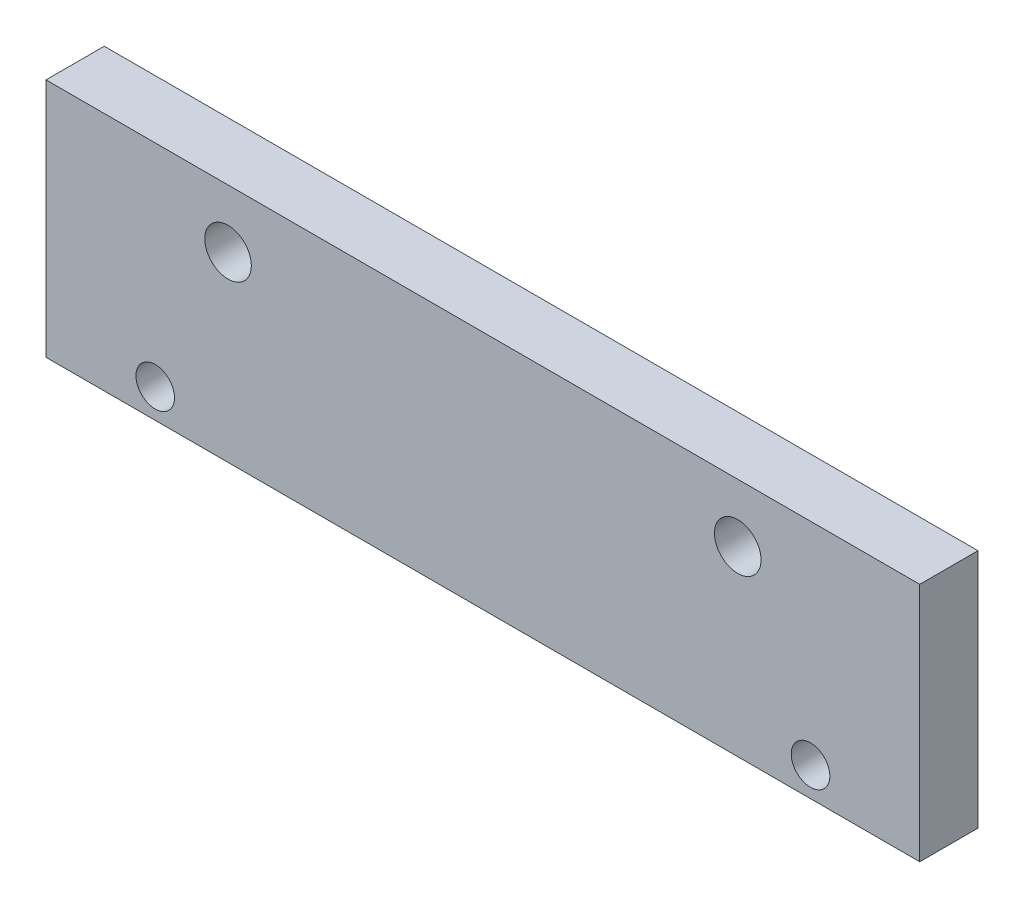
ISO-10303-21;
HEADER;
FILE_DESCRIPTION(('STEP AP214'),'2;1');
FILE_NAME('part.step','',(''),(''),'','','');
FILE_SCHEMA(('AUTOMOTIVE_DESIGN { 1 0 10303 214 1 1 1 1 }'));
ENDSEC;
DATA;
#1=APPLICATION_CONTEXT('core data for automotive mechanical design processes');
#2=APPLICATION_PROTOCOL_DEFINITION('international standard','automotive_design',2000,#1);
#3=PRODUCT_CONTEXT('',#1,'mechanical');
#4=PRODUCT('Part','Part','',(#3));
#5=PRODUCT_RELATED_PRODUCT_CATEGORY('part','',(#4));
#6=PRODUCT_DEFINITION_FORMATION('','',#4);
#7=PRODUCT_DEFINITION_CONTEXT('part definition',#1,'design');
#8=PRODUCT_DEFINITION('design','',#6,#7);
#9=PRODUCT_DEFINITION_SHAPE('','',#8);
#10=(LENGTH_UNIT() NAMED_UNIT(*) SI_UNIT(.MILLI.,.METRE.));
#11=(NAMED_UNIT(*) PLANE_ANGLE_UNIT() SI_UNIT($,.RADIAN.));
#12=(NAMED_UNIT(*) SI_UNIT($,.STERADIAN.) SOLID_ANGLE_UNIT());
#13=UNCERTAINTY_MEASURE_WITH_UNIT(LENGTH_MEASURE(1.E-05),#10,'distance_accuracy_value','');
#14=(GEOMETRIC_REPRESENTATION_CONTEXT(3) GLOBAL_UNCERTAINTY_ASSIGNED_CONTEXT((#13)) GLOBAL_UNIT_ASSIGNED_CONTEXT((#10,
#11,#12)) REPRESENTATION_CONTEXT('',''));
#15=CARTESIAN_POINT('',(0.,0.,0.));
#16=DIRECTION('',(0.,0.,1.));
#17=DIRECTION('',(1.,0.,0.));
#18=AXIS2_PLACEMENT_3D('',#15,#16,#17);
#19=CARTESIAN_POINT('',(-60.0000000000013,0.,8.00000000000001));
#20=DIRECTION('',(1.,0.,0.));
#21=DIRECTION('',(0.,0.,-1.));
#22=AXIS2_PLACEMENT_3D('',#19,#20,#21);
#23=PLANE('',#22);
#24=DIRECTION('',(0.,-1.,0.));
#25=VECTOR('',#24,1.);
#26=CARTESIAN_POINT('',(-60.0000000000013,-7.00550728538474E-13,0.));
#27=LINE('',#26,#25);
#28=CARTESIAN_POINT('',(-59.9999999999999,33.,0.));
#29=VERTEX_POINT('',#28);
#30=CARTESIAN_POINT('',(-60.0000000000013,-7.00550728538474E-13,0.));
#31=VERTEX_POINT('',#30);
#32=EDGE_CURVE('E392',#29,#31,#27,.T.);
#33=ORIENTED_EDGE('',*,*,#32,.T.);
#34=DIRECTION('',(0.,0.,-1.));
#35=VECTOR('',#34,1.);
#36=CARTESIAN_POINT('',(-60.0000000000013,0.,8.00000000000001));
#37=LINE('',#36,#35);
#38=CARTESIAN_POINT('',(-60.0000000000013,0.,8.00000000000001));
#39=VERTEX_POINT('',#38);
#40=EDGE_CURVE('E11',#39,#31,#37,.T.);
#41=ORIENTED_EDGE('',*,*,#40,.F.);
#42=DIRECTION('',(0.,-1.,0.));
#43=VECTOR('',#42,1.);
#44=CARTESIAN_POINT('',(-60.0000000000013,0.,8.00000000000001));
#45=LINE('',#44,#43);
#46=CARTESIAN_POINT('',(-59.9999999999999,33.,8.00000000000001));
#47=VERTEX_POINT('',#46);
#48=EDGE_CURVE('E415',#47,#39,#45,.T.);
#49=ORIENTED_EDGE('',*,*,#48,.F.);
#50=DIRECTION('',(0.,0.,-1.));
#51=VECTOR('',#50,1.);
#52=CARTESIAN_POINT('',(-59.9999999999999,33.,8.00000000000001));
#53=LINE('',#52,#51);
#54=EDGE_CURVE('E404',#47,#29,#53,.T.);
#55=ORIENTED_EDGE('',*,*,#54,.T.);
#56=EDGE_LOOP('',(#33,#41,#49,#55));
#57=FACE_BOUND('',#56,.T.);
#58=ADVANCED_FACE('F348',(#57),#23,.F.);
#59=CARTESIAN_POINT('',(-60.0000000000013,0.,8.00000000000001));
#60=DIRECTION('',(0.,1.,0.));
#61=DIRECTION('',(-1.,0.,0.));
#62=AXIS2_PLACEMENT_3D('',#59,#60,#61);
#63=PLANE('',#62);
#64=DIRECTION('',(1.,0.,0.));
#65=VECTOR('',#64,1.);
#66=CARTESIAN_POINT('',(-60.0000000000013,-7.00550728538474E-13,0.));
#67=LINE('',#66,#65);
#68=CARTESIAN_POINT('',(60.,7.14428516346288E-13,0.));
#69=VERTEX_POINT('',#68);
#70=EDGE_CURVE('E388',#31,#69,#67,.T.);
#71=ORIENTED_EDGE('',*,*,#70,.T.);
#72=DIRECTION('',(0.,0.,-1.));
#73=VECTOR('',#72,1.);
#74=CARTESIAN_POINT('',(60.,7.13463279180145E-13,8.00000000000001));
#75=LINE('',#74,#73);
#76=CARTESIAN_POINT('',(60.,7.13463279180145E-13,8.00000000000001));
#77=VERTEX_POINT('',#76);
#78=EDGE_CURVE('E355',#77,#69,#75,.T.);
#79=ORIENTED_EDGE('',*,*,#78,.F.);
#80=DIRECTION('',(1.,0.,0.));
#81=VECTOR('',#80,1.);
#82=CARTESIAN_POINT('',(-60.0000000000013,0.,8.00000000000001));
#83=LINE('',#82,#81);
#84=EDGE_CURVE('E400',#39,#77,#83,.T.);
#85=ORIENTED_EDGE('',*,*,#84,.F.);
#86=ORIENTED_EDGE('',*,*,#40,.T.);
#87=EDGE_LOOP('',(#71,#79,#85,#86));
#88=FACE_BOUND('',#87,.T.);
#89=ADVANCED_FACE('F399',(#88),#63,.F.);
#90=CARTESIAN_POINT('',(60.,7.13463279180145E-13,8.00000000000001));
#91=DIRECTION('',(-1.,0.,0.));
#92=DIRECTION('',(0.,0.,1.));
#93=AXIS2_PLACEMENT_3D('',#90,#91,#92);
#94=PLANE('',#93);
#95=DIRECTION('',(0.,1.,0.));
#96=VECTOR('',#95,1.);
#97=CARTESIAN_POINT('',(60.,7.14428516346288E-13,0.));
#98=LINE('',#97,#96);
#99=CARTESIAN_POINT('',(60.,33.0000000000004,0.));
#100=VERTEX_POINT('',#99);
#101=EDGE_CURVE('E393',#69,#100,#98,.T.);
#102=ORIENTED_EDGE('',*,*,#101,.T.);
#103=DIRECTION('',(0.,0.,-1.));
#104=VECTOR('',#103,1.);
#105=CARTESIAN_POINT('',(60.,33.0000000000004,8.00000000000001));
#106=LINE('',#105,#104);
#107=CARTESIAN_POINT('',(60.,33.0000000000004,8.00000000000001));
#108=VERTEX_POINT('',#107);
#109=EDGE_CURVE('E421',#108,#100,#106,.T.);
#110=ORIENTED_EDGE('',*,*,#109,.F.);
#111=DIRECTION('',(0.,1.,0.));
#112=VECTOR('',#111,1.);
#113=CARTESIAN_POINT('',(60.,7.13463279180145E-13,8.00000000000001));
#114=LINE('',#113,#112);
#115=EDGE_CURVE('E367',#77,#108,#114,.T.);
#116=ORIENTED_EDGE('',*,*,#115,.F.);
#117=ORIENTED_EDGE('',*,*,#78,.T.);
#118=EDGE_LOOP('',(#102,#110,#116,#117));
#119=FACE_BOUND('',#118,.T.);
#120=ADVANCED_FACE('F424',(#119),#94,.F.);
#121=CARTESIAN_POINT('',(-59.9999999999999,33.,8.00000000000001));
#122=DIRECTION('',(0.,-1.,0.));
#123=DIRECTION('',(1.,0.,0.));
#124=AXIS2_PLACEMENT_3D('',#121,#122,#123);
#125=PLANE('',#124);
#126=DIRECTION('',(-1.,0.,0.));
#127=VECTOR('',#126,1.);
#128=CARTESIAN_POINT('',(-59.9999999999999,33.,0.));
#129=LINE('',#128,#127);
#130=EDGE_CURVE('E413',#100,#29,#129,.T.);
#131=ORIENTED_EDGE('',*,*,#130,.T.);
#132=ORIENTED_EDGE('',*,*,#54,.F.);
#133=DIRECTION('',(-1.,0.,0.));
#134=VECTOR('',#133,1.);
#135=CARTESIAN_POINT('',(-59.9999999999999,33.,8.00000000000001));
#136=LINE('',#135,#134);
#137=EDGE_CURVE('E362',#108,#47,#136,.T.);
#138=ORIENTED_EDGE('',*,*,#137,.F.);
#139=ORIENTED_EDGE('',*,*,#109,.T.);
#140=EDGE_LOOP('',(#131,#132,#138,#139));
#141=FACE_BOUND('',#140,.T.);
#142=ADVANCED_FACE('F426',(#141),#125,.F.);
#143=CARTESIAN_POINT('',(-59.9999999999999,33.,8.00000000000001));
#144=DIRECTION('',(0.,0.,-1.));
#145=DIRECTION('',(-1.,0.,0.));
#146=AXIS2_PLACEMENT_3D('',#143,#144,#145);
#147=PLANE('',#146);
#148=CARTESIAN_POINT('',(-35.,24.9999999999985,8.00000000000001));
#149=DIRECTION('',(0.,0.,1.));
#150=DIRECTION('',(1.,0.,0.));
#151=AXIS2_PLACEMENT_3D('',#148,#149,#150);
#152=CIRCLE('',#151,3.19999999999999);
#153=CARTESIAN_POINT('',(-31.8,24.9999999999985,8.00000000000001));
#154=VERTEX_POINT('',#153);
#155=EDGE_CURVE('E479',#154,#154,#152,.T.);
#156=ORIENTED_EDGE('',*,*,#155,.F.);
#157=EDGE_LOOP('',(#156));
#158=FACE_BOUND('',#157,.T.);
#159=CARTESIAN_POINT('',(35.,24.9999999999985,8.00000000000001));
#160=DIRECTION('',(0.,0.,1.));
#161=DIRECTION('',(1.,0.,0.));
#162=AXIS2_PLACEMENT_3D('',#159,#160,#161);
#163=CIRCLE('',#162,3.19999999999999);
#164=CARTESIAN_POINT('',(38.2,24.9999999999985,8.00000000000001));
#165=VERTEX_POINT('',#164);
#166=EDGE_CURVE('E481',#165,#165,#163,.T.);
#167=ORIENTED_EDGE('',*,*,#166,.F.);
#168=EDGE_LOOP('',(#167));
#169=FACE_BOUND('',#168,.T.);
#170=CARTESIAN_POINT('',(45.,4.00000000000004,8.00000000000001));
#171=DIRECTION('',(0.,0.,-1.));
#172=DIRECTION('',(-1.,0.,0.));
#173=AXIS2_PLACEMENT_3D('',#170,#171,#172);
#174=CIRCLE('',#173,2.65);
#175=CARTESIAN_POINT('',(42.35,4.00000000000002,8.00000000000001));
#176=VERTEX_POINT('',#175);
#177=EDGE_CURVE('E489',#176,#176,#174,.T.);
#178=ORIENTED_EDGE('',*,*,#177,.T.);
#179=EDGE_LOOP('',(#178));
#180=FACE_BOUND('',#179,.T.);
#181=CARTESIAN_POINT('',(-45.,3.9999999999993,8.00000000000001));
#182=DIRECTION('',(0.,0.,-1.));
#183=DIRECTION('',(-1.,0.,0.));
#184=AXIS2_PLACEMENT_3D('',#181,#182,#183);
#185=CIRCLE('',#184,2.65);
#186=CARTESIAN_POINT('',(-47.65,3.99999999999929,8.00000000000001));
#187=VERTEX_POINT('',#186);
#188=EDGE_CURVE('E408',#187,#187,#185,.T.);
#189=ORIENTED_EDGE('',*,*,#188,.T.);
#190=EDGE_LOOP('',(#189));
#191=FACE_BOUND('',#190,.T.);
#192=ORIENTED_EDGE('',*,*,#48,.T.);
#193=ORIENTED_EDGE('',*,*,#84,.T.);
#194=ORIENTED_EDGE('',*,*,#115,.T.);
#195=ORIENTED_EDGE('',*,*,#137,.T.);
#196=EDGE_LOOP('',(#192,#193,#194,#195));
#197=FACE_BOUND('',#196,.T.);
#198=ADVANCED_FACE('F427',(#158,#169,#180,#191,#197),#147,.F.);
#199=CARTESIAN_POINT('',(-59.9999999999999,33.,0.));
#200=DIRECTION('',(0.,0.,-1.));
#201=DIRECTION('',(-1.,0.,0.));
#202=AXIS2_PLACEMENT_3D('',#199,#200,#201);
#203=PLANE('',#202);
#204=CARTESIAN_POINT('',(-35.,24.9999999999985,0.));
#205=DIRECTION('',(0.,0.,1.));
#206=DIRECTION('',(1.,0.,0.));
#207=AXIS2_PLACEMENT_3D('',#204,#205,#206);
#208=CIRCLE('',#207,3.19999999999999);
#209=CARTESIAN_POINT('',(-31.8,24.9999999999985,0.));
#210=VERTEX_POINT('',#209);
#211=EDGE_CURVE('E477',#210,#210,#208,.T.);
#212=ORIENTED_EDGE('',*,*,#211,.T.);
#213=EDGE_LOOP('',(#212));
#214=FACE_BOUND('',#213,.T.);
#215=CARTESIAN_POINT('',(35.,24.9999999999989,0.));
#216=DIRECTION('',(0.,0.,1.));
#217=DIRECTION('',(1.,0.,0.));
#218=AXIS2_PLACEMENT_3D('',#215,#216,#217);
#219=CIRCLE('',#218,3.19999999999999);
#220=CARTESIAN_POINT('',(38.2,24.9999999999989,0.));
#221=VERTEX_POINT('',#220);
#222=EDGE_CURVE('E486',#221,#221,#219,.T.);
#223=ORIENTED_EDGE('',*,*,#222,.T.);
#224=EDGE_LOOP('',(#223));
#225=FACE_BOUND('',#224,.T.);
#226=CARTESIAN_POINT('',(45.,4.00000000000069,0.));
#227=DIRECTION('',(0.,0.,-1.));
#228=DIRECTION('',(-1.,0.,0.));
#229=AXIS2_PLACEMENT_3D('',#226,#227,#228);
#230=CIRCLE('',#229,2.65);
#231=CARTESIAN_POINT('',(42.35,4.00000000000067,0.));
#232=VERTEX_POINT('',#231);
#233=EDGE_CURVE('E492',#232,#232,#230,.T.);
#234=ORIENTED_EDGE('',*,*,#233,.F.);
#235=EDGE_LOOP('',(#234));
#236=FACE_BOUND('',#235,.T.);
#237=CARTESIAN_POINT('',(-45.,3.9999999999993,0.));
#238=DIRECTION('',(0.,0.,-1.));
#239=DIRECTION('',(-1.,0.,0.));
#240=AXIS2_PLACEMENT_3D('',#237,#238,#239);
#241=CIRCLE('',#240,2.65);
#242=CARTESIAN_POINT('',(-47.65,3.99999999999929,0.));
#243=VERTEX_POINT('',#242);
#244=EDGE_CURVE('E405',#243,#243,#241,.T.);
#245=ORIENTED_EDGE('',*,*,#244,.F.);
#246=EDGE_LOOP('',(#245));
#247=FACE_BOUND('',#246,.T.);
#248=ORIENTED_EDGE('',*,*,#32,.F.);
#249=ORIENTED_EDGE('',*,*,#130,.F.);
#250=ORIENTED_EDGE('',*,*,#101,.F.);
#251=ORIENTED_EDGE('',*,*,#70,.F.);
#252=EDGE_LOOP('',(#248,#249,#250,#251));
#253=FACE_BOUND('',#252,.T.);
#254=ADVANCED_FACE('F389',(#214,#225,#236,#247,#253),#203,.T.);
#255=CARTESIAN_POINT('',(-45.,3.9999999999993,0.));
#256=DIRECTION('',(0.,0.,-1.));
#257=DIRECTION('',(-1.,0.,0.));
#258=AXIS2_PLACEMENT_3D('',#255,#256,#257);
#259=CYLINDRICAL_SURFACE('',#258,2.65);
#260=ORIENTED_EDGE('',*,*,#188,.F.);
#261=EDGE_LOOP('',(#260));
#262=FACE_BOUND('',#261,.T.);
#263=ORIENTED_EDGE('',*,*,#244,.T.);
#264=EDGE_LOOP('',(#263));
#265=FACE_BOUND('',#264,.T.);
#266=ADVANCED_FACE('F434',(#262,#265),#259,.F.);
#267=CARTESIAN_POINT('',(45.,4.00000000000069,0.));
#268=DIRECTION('',(0.,0.,-1.));
#269=DIRECTION('',(-1.,0.,0.));
#270=AXIS2_PLACEMENT_3D('',#267,#268,#269);
#271=CYLINDRICAL_SURFACE('',#270,2.65);
#272=ORIENTED_EDGE('',*,*,#177,.F.);
#273=EDGE_LOOP('',(#272));
#274=FACE_BOUND('',#273,.T.);
#275=ORIENTED_EDGE('',*,*,#233,.T.);
#276=EDGE_LOOP('',(#275));
#277=FACE_BOUND('',#276,.T.);
#278=ADVANCED_FACE('F455',(#274,#277),#271,.F.);
#279=CARTESIAN_POINT('',(35.,24.9999999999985,8.00000000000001));
#280=DIRECTION('',(0.,0.,1.));
#281=DIRECTION('',(1.,0.,0.));
#282=AXIS2_PLACEMENT_3D('',#279,#280,#281);
#283=CYLINDRICAL_SURFACE('',#282,3.19999999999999);
#284=ORIENTED_EDGE('',*,*,#222,.F.);
#285=EDGE_LOOP('',(#284));
#286=FACE_BOUND('',#285,.T.);
#287=ORIENTED_EDGE('',*,*,#166,.T.);
#288=EDGE_LOOP('',(#287));
#289=FACE_BOUND('',#288,.T.);
#290=ADVANCED_FACE('F461',(#286,#289),#283,.F.);
#291=CARTESIAN_POINT('',(-35.,24.9999999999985,8.00000000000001));
#292=DIRECTION('',(0.,0.,1.));
#293=DIRECTION('',(1.,0.,0.));
#294=AXIS2_PLACEMENT_3D('',#291,#292,#293);
#295=CYLINDRICAL_SURFACE('',#294,3.19999999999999);
#296=ORIENTED_EDGE('',*,*,#211,.F.);
#297=EDGE_LOOP('',(#296));
#298=FACE_BOUND('',#297,.T.);
#299=ORIENTED_EDGE('',*,*,#155,.T.);
#300=EDGE_LOOP('',(#299));
#301=FACE_BOUND('',#300,.T.);
#302=ADVANCED_FACE('F467',(#298,#301),#295,.F.);
#303=CLOSED_SHELL('',(#58,#89,#120,#142,#198,#254,#266,#278,#290,#302));
#304=MANIFOLD_SOLID_BREP('B2',#303);
#305=ADVANCED_BREP_SHAPE_REPRESENTATION('',(#18,#304),#14);
#306=SHAPE_DEFINITION_REPRESENTATION(#9,#305);
ENDSEC;
END-ISO-10303-21;
